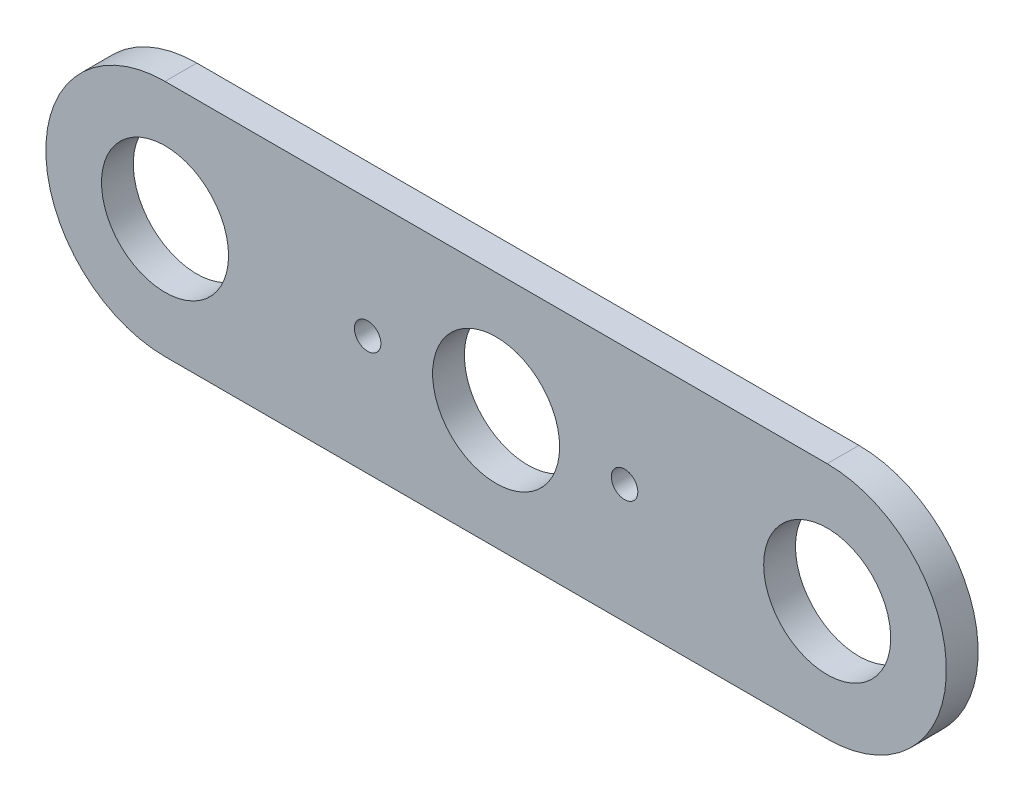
from build123d import *

# Parameters (mm, degrees)
SKETCH2_R           = 11.99
BOSS_EXTRUDE1_DEPTH = 6
SKETCH3_R           = 2.5
CUT_EXTRUDE1_DEPTH  = 10


with BuildPart() as part:
    # Sketch2 → Boss-Extrude1 (new body)
    with BuildSketch(Plane.XY):
        with BuildLine():
            Line((-62.5, -22.5), (62.5, -22.5))
            ThreePointArc((62.5, -22.5), (85, 0), (62.5, 22.5))
            Line((62.5, 22.5), (-62.5, 22.5))
            ThreePointArc((-62.5, 22.5), (-85, 0), (-62.5, -22.5))
        make_face()
        with Locations((-62.5, 0)):
            Circle(SKETCH2_R, mode=Mode.SUBTRACT)
        with Locations(Location((62.5, 0, 0), (0, 0, 180))):
            Circle(SKETCH2_R, mode=Mode.SUBTRACT)
        Circle(SKETCH2_R, mode=Mode.SUBTRACT)
    extrude(amount=BOSS_EXTRUDE1_DEPTH)

    # Sketch3 → Cut-Extrude1 (cut)
    with BuildSketch(Plane.XY.offset(6)):
        with Locations((-24.25, 0)):
            Circle(SKETCH3_R)
        with Locations((24.25, 0)):
            Circle(SKETCH3_R)
    extrude(amount=-CUT_EXTRUDE1_DEPTH, mode=Mode.SUBTRACT)


solid = part.part
